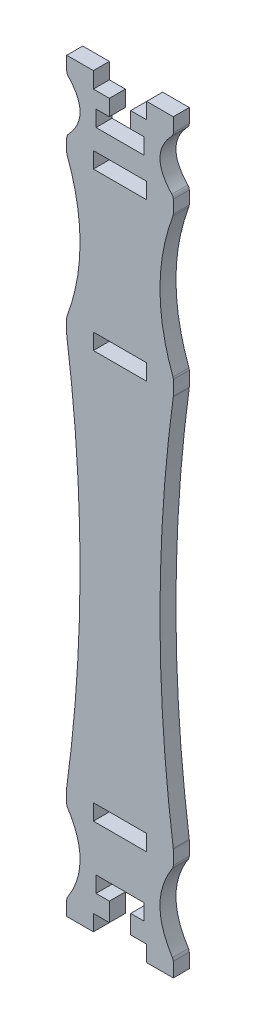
from build123d import *

# Parameters (mm, degrees)
CROQUIS1_W              = 10
CROQUIS1_H              = 3
SALIENTE_EXTRUIR1_DEPTH = 3


with BuildPart() as part:
    # Croquis1 → Saliente-Extruir1 (new body)
    with BuildSketch(Plane.XY):
        with BuildLine():
            Line((-15, -70), (-10, -70))
            Line((-10, -70), (-10, -67))
            Line((-10, -67), (-7, -67))
            Line((-7, -67), (-7, -63.5))
            Line((-7, -63.5), (-9.5, -63.5))
            Line((-9.5, -63.5), (-9.5, -60.5))
            Line((-9.5, -60.5), (-0.5, -60.5))
            Line((-0.5, -60.5), (-0.5, -63.5))
            Line((-0.5, -63.5), (-3, -63.5))
            Line((-3, -63.5), (-3, -67))
            Line((-3, -67), (0, -67))
            Line((0, -67), (0, -70))
            Line((0, -70), (5, -70))
            Line((5, -70), (5, -67.298618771))
            ThreePointArc((5, -67.298618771), (4.959256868, -67.016083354), (4.840347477, -66.756570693))
            add(Edge.make_bspline(
                [(4.840347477, -66.756570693), (3.280115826, -64.337713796), (1.719884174, -59.5), (3.280115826, -54.662286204), (4.840347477, -52.243429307)],
                knots=[0.01622862, 0.01622862, 0.01622862, 0.01622862, 0.5, 0.98377138, 0.98377138, 0.98377138, 0.98377138], degree=3))
            ThreePointArc((4.840347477, -52.243429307), (4.959256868, -51.983916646), (5, -51.701381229))
            Line((5, -51.701381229), (5, -49.067654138))
            ThreePointArc((5, -49.067654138), (4.997723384, -49.000214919), (4.990903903, -48.933082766))
            add(Edge.make_bspline(
                [(4.990903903, -48.933082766), (3.330301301, -36.70538851), (1.669698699, -12.25), (3.330301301, 12.20538851), (4.990903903, 24.433082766)],
                knots=[0.000910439, 0.000910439, 0.000910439, 0.000910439, 0.5, 0.999089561, 0.999089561, 0.999089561, 0.999089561], degree=3))
            ThreePointArc((4.990903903, 24.433082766), (4.997723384, 24.500214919), (5, 24.567654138))
            Line((5, 24.567654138), (5, 27.318685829))
            ThreePointArc((5, 27.318685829), (4.9841425, 27.496065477), (4.937072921, 27.667819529))
            add(Edge.make_bspline(
                [(4.937072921, 53.832180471), (3.31235764, 49.471453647), (1.68764236, 40.75), (3.31235764, 32.028546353), (4.937072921, 27.667819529)],
                knots=[0.006332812, 0.006332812, 0.006332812, 0.006332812, 0.5, 0.993667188, 0.993667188, 0.993667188, 0.993667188], degree=3))
            ThreePointArc((4.937072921, 53.832180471), (4.9841425, 54.003934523), (5, 54.181314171))
            Line((5, 54.181314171), (5, 56.594252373))
            ThreePointArc((5, 56.594252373), (4.929306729, 56.963561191), (4.727221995, 57.280654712))
            add(Edge.make_bspline(
                [(4.727221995, 66.719345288), (3.242407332, 65.146230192), (1.757592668, 62), (3.242407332, 58.853769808), (4.727221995, 57.280654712)],
                knots=[0.028065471, 0.028065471, 0.028065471, 0.028065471, 0.5, 0.971934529, 0.971934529, 0.971934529, 0.971934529], degree=3))
            ThreePointArc((4.727221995, 66.719345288), (4.929306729, 67.036438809), (5, 67.405747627))
            Line((5, 67.405747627), (5, 70))
            Line((5, 70), (0, 70))
            Line((0, 70), (0, 67))
            Line((0, 67), (-3, 67))
            Line((-3, 67), (-3, 64))
            Line((-3, 64), (-0.5, 64))
            Line((-0.5, 64), (-0.5, 61))
            Line((-0.5, 61), (-9.5, 61))
            Line((-9.5, 61), (-9.5, 64))
            Line((-9.5, 64), (-7, 64))
            Line((-7, 64), (-7, 67))
            Line((-7, 67), (-10, 67))
            Line((-10, 67), (-10, 70))
            Line((-10, 70), (-15, 70))
            Line((-15, 70), (-15, 67.405747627))
            ThreePointArc((-15, 67.405747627), (-14.929306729, 67.036438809), (-14.727221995, 66.719345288))
            add(Edge.make_bspline(
                [(-14.727221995, 57.280654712), (-13.242407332, 58.853769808), (-11.757592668, 62), (-13.242407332, 65.146230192), (-14.727221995, 66.719345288)],
                knots=[0.028065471, 0.028065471, 0.028065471, 0.028065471, 0.5, 0.971934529, 0.971934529, 0.971934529, 0.971934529], degree=3))
            ThreePointArc((-14.727221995, 57.280654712), (-14.929306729, 56.963561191), (-15, 56.594252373))
            Line((-15, 56.594252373), (-15, 54.181314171))
            ThreePointArc((-15, 54.181314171), (-14.9841425, 54.003934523), (-14.937072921, 53.832180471))
            add(Edge.make_bspline(
                [(-14.937072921, 53.832180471), (-13.31235764, 49.471453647), (-11.68764236, 40.75), (-13.31235764, 32.028546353), (-14.937072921, 27.667819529)],
                knots=[0.006332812, 0.006332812, 0.006332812, 0.006332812, 0.5, 0.993667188, 0.993667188, 0.993667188, 0.993667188], degree=3))
            ThreePointArc((-14.937072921, 27.667819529), (-14.9841425, 27.496065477), (-15, 27.318685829))
            Line((-15, 27.318685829), (-15, 24.567654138))
            ThreePointArc((-15, 24.567654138), (-14.997723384, 24.500214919), (-14.990903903, 24.433082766))
            add(Edge.make_bspline(
                [(-14.990903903, -48.933082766), (-13.330301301, -36.70538851), (-11.669698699, -12.25), (-13.330301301, 12.20538851), (-14.990903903, 24.433082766)],
                knots=[0.000910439, 0.000910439, 0.000910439, 0.000910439, 0.5, 0.999089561, 0.999089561, 0.999089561, 0.999089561], degree=3))
            ThreePointArc((-14.990903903, -48.933082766), (-14.997723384, -49.000214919), (-15, -49.067654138))
            Line((-15, -49.067654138), (-15, -51.701381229))
            ThreePointArc((-15, -51.701381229), (-14.959256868, -51.983916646), (-14.840347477, -52.243429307))
            add(Edge.make_bspline(
                [(-14.840347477, -66.756570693), (-13.280115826, -64.337713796), (-11.719884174, -59.5), (-13.280115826, -54.662286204), (-14.840347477, -52.243429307)],
                knots=[0.01622862, 0.01622862, 0.01622862, 0.01622862, 0.5, 0.98377138, 0.98377138, 0.98377138, 0.98377138], degree=3))
            ThreePointArc((-14.840347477, -66.756570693), (-14.959256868, -67.016083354), (-15, -67.298618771))
            Line((-15, -67.298618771), (-15, -70))
        make_face()
        with Locations((-5, -50.5)):
            Rectangle(CROQUIS1_W, CROQUIS1_H, mode=Mode.SUBTRACT)
        with Locations((-5, 26)):
            Rectangle(CROQUIS1_W, CROQUIS1_H, mode=Mode.SUBTRACT)
        with Locations((-5, 55.5)):
            Rectangle(CROQUIS1_W, CROQUIS1_H, mode=Mode.SUBTRACT)
    extrude(amount=SALIENTE_EXTRUIR1_DEPTH)


solid = part.part
